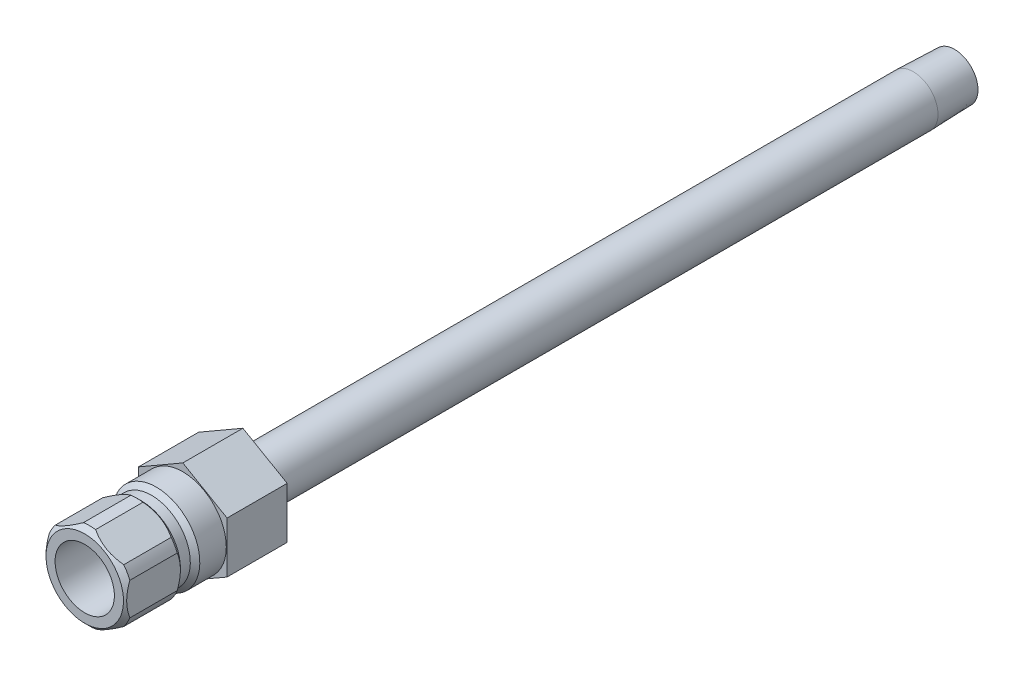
from build123d import *

# Parameters (mm, degrees)
SKETCH2_R           = 2.6543
BOSS_EXTRUDE1_DEPTH = 9.652
CUT_EXTRUDE1_START  = 6.604
SKETCH3_OUTSIDE_W   = 44.5
SKETCH3_OUTSIDE_H   = 46.7
CUT_EXTRUDE1_DEPTH  = 118.823165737


with BuildPart() as part:
    # Sketch1 → Revolve1 (revolve)
    with BuildSketch(Plane(origin=(0, 0, 0), x_dir=(0, 0, -1), z_dir=(1, 0, 0))):
        Polygon((-15.748, 4.7625), (-15.748, 6.223), (-14.986, 6.985), (-7.366, 6.985), (-6.604, 6.223), (-5.0165, 6.223), (-4.2545, 6.985), (9.652, 6.985), (9.652, 3.96875), (117.3226, 3.96875), (123.952, 3.761582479), (123.952, 2.6543), (-2.435050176, 2.6543), (-3.556, 4.7625), align=None)
    revolve(axis=Axis((0, 0, -9.652), (0, 0, 1)))

    # Sketch2 → Boss-Extrude1 (add)
    with BuildSketch(Plane.XY):
        Polygon((-7.112, 4.106115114), (-7.112, -4.106115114), (0, -8.212230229), (7.112, -4.106115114), (7.112, 4.106115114), (0, 8.212230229), align=None)
        with Locations(Location((0, 0, 0), (0, 0, 90))):
            Circle(SKETCH2_R, mode=Mode.SUBTRACT)
    extrude(amount=-BOSS_EXTRUDE1_DEPTH)

    # Sketch3 outside → Cut-Extrude1 (cut, through all)
    with BuildSketch(Plane.XY.offset(CUT_EXTRUDE1_START)):
        Rectangle(SKETCH3_OUTSIDE_W, SKETCH3_OUTSIDE_H)
        Polygon((6.477, 3.739497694), (0, 7.478995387), (-6.477, 3.739497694), (-6.477, -3.739497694), (0, -7.478995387), (6.477, -3.739497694), align=None, mode=Mode.SUBTRACT)
    extrude(amount=CUT_EXTRUDE1_DEPTH, mode=Mode.SUBTRACT)


solid = part.part
